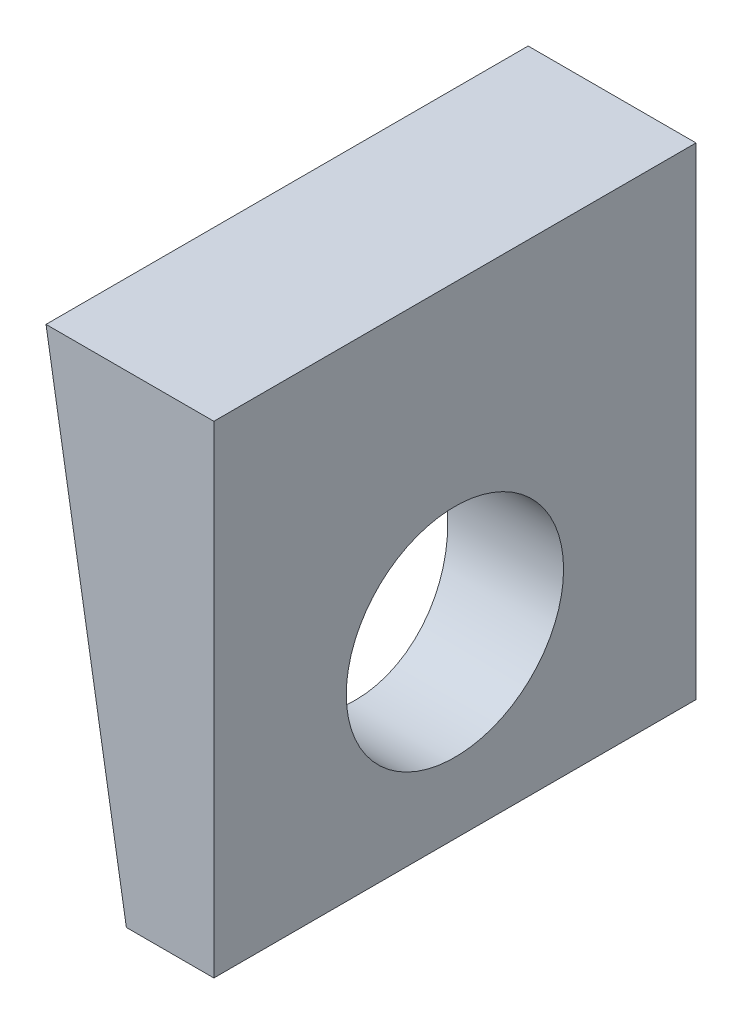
from build123d import *

# Parameters (mm, degrees)
BOSS_EXTRUDE1_DEPTH = 14.96314
SKETCH2_R           = 6.7437
CUT_EXTRUDE1_DEPTH  = 24.58685066


with BuildPart() as part:
    # Sketch1 → Boss-Extrude1 (new, symmetric)
    with BuildSketch(Plane.XY):
        Polygon((-5.430943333, -14.96314), (0, -14.96314), (0, 14.96314), (-10.418656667, 14.96314), align=None)
    extrude(amount=BOSS_EXTRUDE1_DEPTH, both=True)

    # Sketch2 → Cut-Extrude1 (cut, through all)
    with BuildSketch(Plane(origin=(0, 0, 0), x_dir=(0, 0, -1), z_dir=(1, 0, 0))):
        with Locations((0, -3.83794)):
            Circle(SKETCH2_R)
    extrude(amount=-CUT_EXTRUDE1_DEPTH, mode=Mode.SUBTRACT)


solid = part.part
